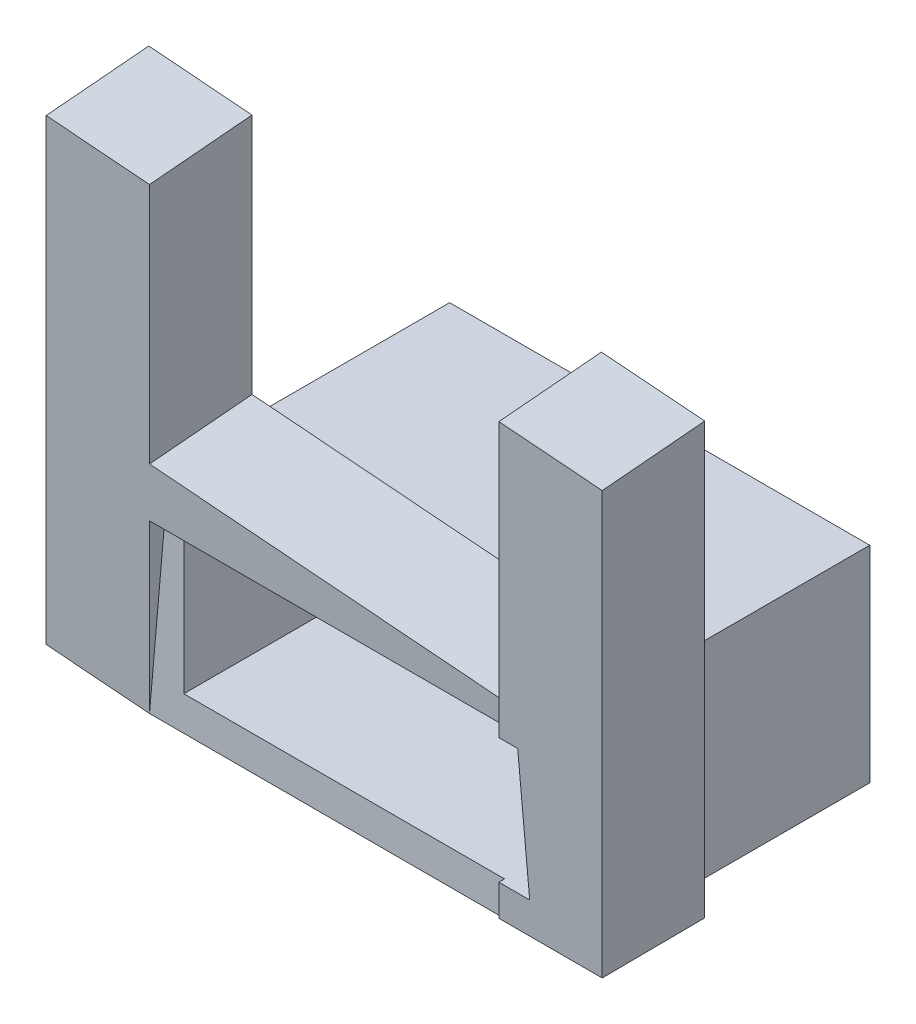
from build123d import *

# Parameters (mm, degrees)
SKETCH4_W             = 12
SKETCH4_H             = 12
BOSS_EXTRUDE1_DEPTH   = 59
BOSS_EXTRUDE1_2_DEPTH = 59
ATTATCH_SLIDE_W       = 49
ATTATCH_SLIDE_H       = 24
ATTATCH_SLIDE_W_2     = 41
ATTATCH_SLIDE_H_2     = 16
BOSS_EXTRUDE2_DEPTH   = 35
SKETCH8_W             = 41
SKETCH8_H             = 16
CUT_EXTRUDE1_DEPTH    = 93.942381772
SKETCH9_W             = 64.384567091
SKETCH9_H             = 9.25384397
CUT_EXTRUDE2_DEPTH    = 93.942381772
BOSS_EXTRUDE3_DEPTH   = 12


with BuildPart() as part:
    # Sketch4 → Boss-Extrude1 (new body)
    with BuildSketch(Plane(origin=(0, 0, 0), x_dir=(0.9962234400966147, -0.08649619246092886, -0.007567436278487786), z_dir=(0.08682659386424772, 0.9924325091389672, 0.08682659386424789))):
        with Locations((-6, 6)):
            Rectangle(SKETCH4_W, SKETCH4_H)
    extrude(amount=BOSS_EXTRUDE1_DEPTH)



with BuildPart() as body_2:
    # Sketch4 → Boss-Extrude1 2 (new body)
    with BuildSketch(Plane(origin=(0, 0, 0), x_dir=(0.9962234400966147, -0.08649619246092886, -0.007567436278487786), z_dir=(0.08682659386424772, 0.9924325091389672, 0.08682659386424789))):
        with Locations((46.90667649, 5.689258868)):
            Rectangle(SKETCH4_W, SKETCH4_H)
    extrude(amount=BOSS_EXTRUDE1_2_DEPTH)

    # Sketch8 → Cut-Extrude1 (cut, through all)
    with BuildSketch(Plane(origin=(0, 0, -35), x_dir=(-1, 0, 0), z_dir=(0, 0, -1))):
        with Locations((-24.5, 12)):
            Rectangle(SKETCH8_W, SKETCH8_H)
    extrude(amount=-CUT_EXTRUDE1_DEPTH, mode=Mode.SUBTRACT)

    # Sketch9 → Cut-Extrude2 (cut, through all)
    with BuildSketch(Plane(origin=(0, 0, -35), x_dir=(-1, 0, 0), z_dir=(0, 0, -1))):
        with Locations((-32.192283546, -4.626921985)):
            Rectangle(SKETCH9_W, SKETCH9_H)
    extrude(amount=-CUT_EXTRUDE2_DEPTH, mode=Mode.SUBTRACT)


with BuildPart() as body_3:
    # attatch slide → Boss-Extrude2 (new body)
    with BuildSketch(Plane.XY):
        with Locations((24.5, 12)):
            Rectangle(ATTATCH_SLIDE_W, ATTATCH_SLIDE_H)
        with Locations((24.5, 12)):
            Rectangle(ATTATCH_SLIDE_W_2, ATTATCH_SLIDE_H_2, mode=Mode.SUBTRACT)
    extrude(amount=-BOSS_EXTRUDE2_DEPTH)


with BuildPart() as part_1:
    add(part.part)

    add(body_2.part)  # Boss-Extrude3 merges body 2

    add(body_3.part)  # Boss-Extrude3 merges body 3
    # Sketch11 → Boss-Extrude3 (add)
    with BuildSketch(Plane(origin=(0, 0, 0), x_dir=(1, 0, 0), z_dir=(0, -0.0871557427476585, 0.9961946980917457))):
        Polygon((-1.857409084, 21.411403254), (44.344425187, 21.411403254), (43.045646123, 24.17146719), (-1.857409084, 28.099975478), align=None)
    extrude(amount=-BOSS_EXTRUDE3_DEPTH)


solid = part_1.part
